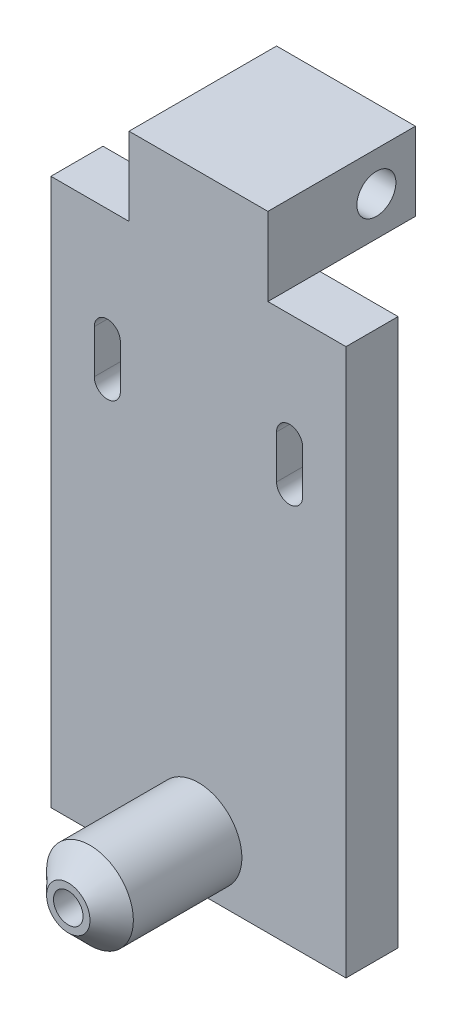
from build123d import *

# Parameters (mm, degrees)
ESQUISSE1_W             = 68
ESQUISSE1_H             = 126
EXTRUSION1_DEPTH        = 12
ESQUISSE2_R             = 10
EXTRUSION2_DEPTH        = 30
CHANFREIN1_SIZE         = 5
TROU_TARAUD_M81_D       = 6.8
TROU_TARAUD_M81_DEPTH   = 24
TROU_TARAUD_M81_TIP     = 2.042926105
ESQUISSE5_W             = 32
ESQUISSE5_H             = 34
EXTRUSION3_DEPTH        = 18
ESQUISSE6_R             = 4.5
ENL_V_MAT_EXTRU_1_DEPTH = 159.113883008
ENL_V_MAT_EXTRU_2_DEPTH = 163.837342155


with BuildPart() as part:
    # Esquisse1 → Extrusion1 (new body)
    with BuildSketch(Plane.XY):
        with Locations((34, 63)):
            Rectangle(ESQUISSE1_W, ESQUISSE1_H)
    extrude(amount=EXTRUSION1_DEPTH)

    # Esquisse2 → Extrusion2 (add)
    with BuildSketch(Plane.XY.offset(12)):
        with Locations(Location((34, 12, 0), (0, 0, 180))):
            Circle(ESQUISSE2_R)
    extrude(amount=EXTRUSION2_DEPTH)

    # Chanfrein1
    chanfrein1_edges = [part.edges().sort_by_distance(p)[0] for p in [
        (44, 12, 42),
    ]]
    chamfer(chanfrein1_edges, length=CHANFREIN1_SIZE)

    # Trou taraud_ M81
    with Locations(Plane.XY.offset(42)):
        with Locations((34, 12)):
            Hole(TROU_TARAUD_M81_D / 2, depth=TROU_TARAUD_M81_DEPTH)
            with Locations((0, 0, -(TROU_TARAUD_M81_DEPTH + TROU_TARAUD_M81_TIP / 2))):  # 118° drill point
                Cone(0, TROU_TARAUD_M81_D / 2, TROU_TARAUD_M81_TIP, mode=Mode.SUBTRACT)

    # Esquisse5 → Extrusion3 (add)
    with BuildSketch(Plane(origin=(0, 126, 0), x_dir=(1, 0, 0), z_dir=(0, 1, 0))):
        with Locations((34, 5)):
            Rectangle(ESQUISSE5_W, ESQUISSE5_H)
    extrude(amount=EXTRUSION3_DEPTH)

    # Esquisse6 → Enl_v. mat.-Extru.1 (cut, through all)
    with BuildSketch(Plane.ZY.offset(-18)):
        with Locations((-13, 135)):
            Circle(ESQUISSE6_R)
    extrude(amount=-ENL_V_MAT_EXTRU_1_DEPTH, mode=Mode.SUBTRACT)

    # Esquisse7 → Enl_v. mat.-Extru.2 (cut, through all)
    with BuildSketch(Plane.XY.offset(12)):
        with BuildLine():
            Line((10, 101), (10, 91))
            ThreePointArc((10, 91), (13, 88), (16, 91))
            Line((16, 91), (16, 101))
            ThreePointArc((16, 101), (13, 104), (10, 101))
        make_face()
        with BuildLine():
            Line((52, 101), (52, 91))
            ThreePointArc((52, 91), (55, 88), (58, 91))
            Line((58, 91), (58, 101))
            ThreePointArc((58, 101), (55, 104), (52, 101))
        make_face()
    extrude(amount=-ENL_V_MAT_EXTRU_2_DEPTH, mode=Mode.SUBTRACT)


solid = part.part
